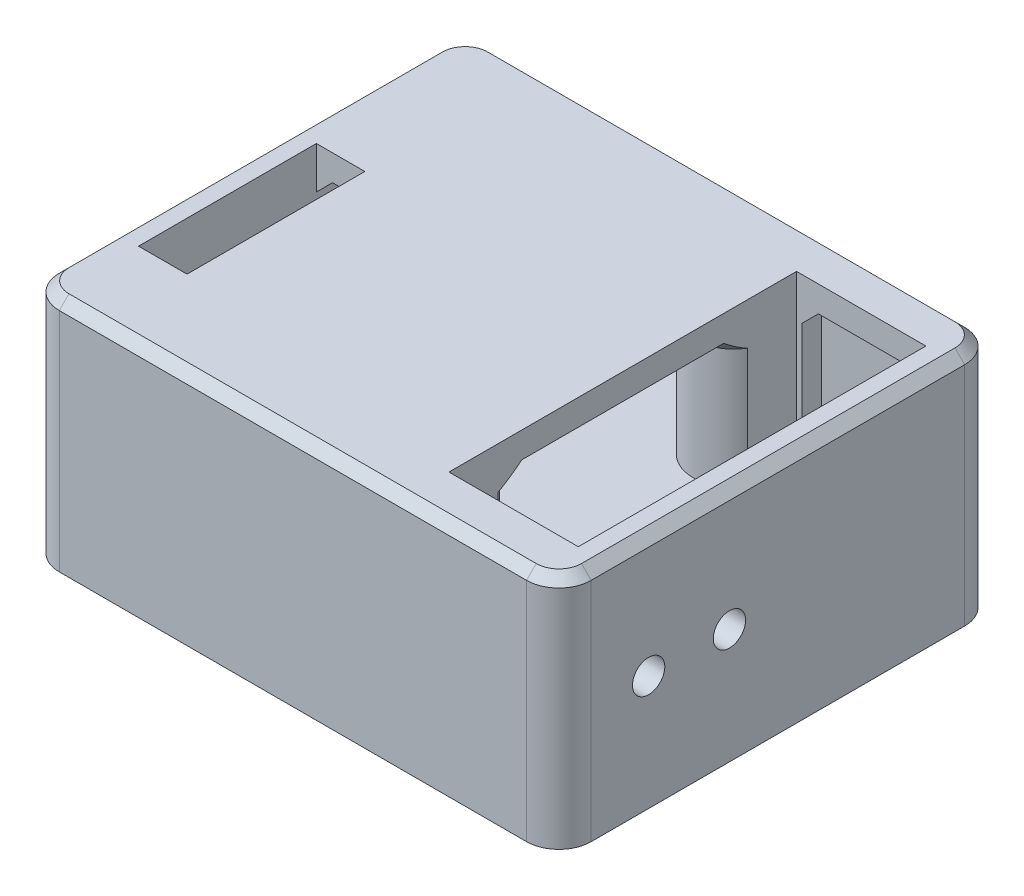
from build123d import *

# Parameters (mm, degrees)
SKICA1_W                         = 29.2
SKICA1_H                         = 23.4
P_IDAT_VYSUNUT_M1_DEPTH          = 1.2
SKICA2_R                         = 1.5
ODEBRAT_VYSUNUT_M1_DEPTH         = 19.748066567
VYSUNOUT_TENKOST_NN_1_DEPTH      = 10
VYSUNOUT_TENKOST_NN_1_DEPTH_BACK = 4.6
SKICA3_W                         = 32.9
SKICA3_H                         = 27.1
SKICA3_W_2                       = 29.7
SKICA3_H_2                       = 23.9
SKICA4_W                         = 32.9
SKICA4_H                         = 27.1
P_IDAT_VYSUNUT_M2_DEPTH          = 1.6
SKICA6_R                         = 1.35
P_IDAT_VYSUNUT_M3_DEPTH          = 8.4
ZKOSEN_1_SIZE                    = 1
ODEBRAT_START                    = -11.2
SKICA5_W                         = 8
SKICA5_H                         = 21.5
SKICA5_W_2                       = 3
SKICA5_H_2                       = 11
ODEBRAT_VYSUNUT_M2_DEPTH         = 11.2
ZAOBLIT1_R                       = 2
ZKOSEN_2_SIZE                    = 0.6
SKICA7_R                         = 1
ODEBRAT_VYSUNUT_M3_DEPTH         = 36.54282628
SKICA8_W                         = 29.2
SKICA8_H                         = 23.4
P_IDAT_VYSUNUT_M4_DEPTH          = 1.6
SKICA9_W                         = 20.2
SKICA9_H                         = 23.4
SKICA9_R                         = 1.6
P_IDAT_VYSUNUT_M5_DEPTH          = 1.6
SKICA10_R                        = 1.6
ODEBRAT_VYSUNUT_M4_DEPTH         = 25.964074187


with BuildPart() as part:
    # Skica1 → P_idat vysunut_m1 (new body)
    with BuildSketch(Plane(origin=(0, 0, 0), x_dir=(1, 0, 0), z_dir=(0, 1, 0))):
        Rectangle(SKICA1_W, SKICA1_H)
    extrude(amount=-P_IDAT_VYSUNUT_M1_DEPTH)

    # Skica2 → Odebrat vysunut_m1 (cut, through all)
    with BuildSketch(Plane(origin=(0, 0, 0), x_dir=(1, 0, 0), z_dir=(0, 1, 0))):
        with Locations(Location((-8.6, 9, 0), (0, 0, 270))):
            Circle(SKICA2_R)
        with Locations(Location((4.7, 9, 0), (0, 0, 270))):
            Circle(SKICA2_R)
        with Locations(Location((4.7, -9, 0), (0, 0, 90))):
            Circle(SKICA2_R)
        with Locations(Location((-8.6, -9, 0), (0, 0, 90))):
            Circle(SKICA2_R)
    extrude(amount=-ODEBRAT_VYSUNUT_M1_DEPTH, mode=Mode.SUBTRACT)


with BuildPart() as body_2:
    # Skica3 → Vysunout tenkost_nn_1 (new, two sides: drawn at the far end of the back side and taken through both)
    with BuildSketch(Plane(origin=(0, 0, 0), x_dir=(1, 0, 0), z_dir=(0, 1, 0)).offset(-VYSUNOUT_TENKOST_NN_1_DEPTH_BACK)):
        Rectangle(SKICA3_W, SKICA3_H)
        Rectangle(SKICA3_W_2, SKICA3_H_2, mode=Mode.SUBTRACT)
    extrude(amount=VYSUNOUT_TENKOST_NN_1_DEPTH + VYSUNOUT_TENKOST_NN_1_DEPTH_BACK)

    # Skica4 → P_idat vysunut_m2 (add)
    with BuildSketch(Plane(origin=(0, 10, 0), x_dir=(1, 0, 0), z_dir=(0, 1, 0))):
        Rectangle(SKICA4_W, SKICA4_H)
    extrude(amount=-P_IDAT_VYSUNUT_M2_DEPTH)

    # Skica6 → P_idat vysunut_m3 (add)
    # profile 1 of 4: a face of its own
    with BuildSketch(Plane.XZ.offset(-8.4)):
        with BuildLine():
            Line((-11.1, 9), (-11.1, 11.95))
            Line((-11.1, 11.95), (-6.1, 11.95))
            Line((-6.1, 11.95), (-6.1, 9))
            ThreePointArc((-6.1, 9), (-8.6, 6.5), (-11.1, 9))
        make_face()
        with Locations(Location((-8.6, 9, 0), (0, 0, 270))):
            Circle(SKICA6_R, mode=Mode.SUBTRACT)
    # profile 2 of 4: a face of its own
    with BuildSketch(Plane.XZ.offset(-8.4)):
        with BuildLine():
            Line((2.2, 9), (2.2, 11.95))
            Line((2.2, 11.95), (7.2, 11.95))
            Line((7.2, 11.95), (7.2, 9))
            ThreePointArc((7.2, 9), (4.7, 6.5), (2.2, 9))
        make_face()
        with Locations(Location((4.7, 9, 0), (0, 0, 270))):
            Circle(SKICA6_R, mode=Mode.SUBTRACT)
    # profile 3 of 4: a face of its own
    with BuildSketch(Plane.XZ.offset(-8.4)):
        with BuildLine():
            Line((7.2, -11.95), (7.2, -9))
            ThreePointArc((7.2, -9), (4.7, -6.5), (2.2, -9))
            Line((2.2, -9), (2.2, -11.95))
            Line((2.2, -11.95), (7.2, -11.95))
        make_face()
        with Locations(Location((4.7, -9, 0), (0, 0, 90))):
            Circle(SKICA6_R, mode=Mode.SUBTRACT)
    # profile 4 of 4: a face of its own
    with BuildSketch(Plane.XZ.offset(-8.4)):
        with BuildLine():
            Line((-6.1, -11.95), (-6.1, -9))
            ThreePointArc((-6.1, -9), (-8.6, -6.5), (-11.1, -9))
            Line((-11.1, -9), (-11.1, -11.95))
            Line((-11.1, -11.95), (-6.1, -11.95))
        make_face()
        with Locations(Location((-8.6, -9, 0), (0, 0, 90))):
            Circle(SKICA6_R, mode=Mode.SUBTRACT)
    extrude(amount=P_IDAT_VYSUNUT_M3_DEPTH)

    # Zkosen_1
    zkosen_1_edges = [body_2.edges().sort_by_distance(p)[0] for p in [
        (4.7, 8.4, -6.5),
        (2.2, 8.4, -10.475),
        (7.2, 8.4, -10.475),
        (-12.975, 8.4, -11.95),
        (-8.6, 8.4, -6.5),
        (-11.1, 8.4, -10.475),
        (-6.1, 8.4, -10.475),
        (-14.85, 8.4, 0),
        (-12.975, 8.4, 11.95),
        (14.85, 8.4, 0),
        (11.025, 8.4, -11.95),
        (11.025, 8.4, 11.95),
        (4.7, 8.4, 6.5),
        (7.2, 8.4, 10.475),
        (2.2, 8.4, 10.475),
        (-1.95, 8.4, 11.95),
        (-8.6, 8.4, 6.5),
        (-6.1, 8.4, 10.475),
        (-11.1, 8.4, 10.475),
        (-1.95, 8.4, -11.95),
    ]]
    chamfer(zkosen_1_edges, length=ZKOSEN_1_SIZE)

    # Skica5 → Odebrat vysunut_m2 (cut)
    with BuildSketch(Plane(origin=(0, 10, 0), x_dir=(1, 0, 0), z_dir=(0, 1, 0)).offset(ODEBRAT_START)):
        with Locations((10.85, 0)):
            Rectangle(SKICA5_W, SKICA5_H)
        with Locations((-13.35, -2.75)):
            Rectangle(SKICA5_W_2, SKICA5_H_2)
    extrude(amount=ODEBRAT_VYSUNUT_M2_DEPTH, mode=Mode.SUBTRACT)

    # Zaoblit1
    zaoblit1_edges = [body_2.edges().sort_by_distance(p)[0] for p in [
        (-16.45, 2.7, 13.55),
        (-16.45, 2.7, -13.55),
        (16.45, 2.7, -13.55),
        (16.45, 2.7, 13.55),
    ]]
    fillet(zaoblit1_edges, radius=ZAOBLIT1_R)

    # Zkosen_2
    zkosen_2_edges = [body_2.edges().sort_by_distance(p)[0] for p in [
        (-16.45, 10, 0),
        (0, 10, -13.55),
        (0, 10, 13.55),
        (16.45, 10, 0),
        (15.864213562, 10, 12.964213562),
        (-15.864213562, 10, 12.964213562),
        (15.864213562, 10, -12.964213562),
        (-15.864213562, 10, -12.964213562),
    ]]
    chamfer(zkosen_2_edges, length=ZKOSEN_2_SIZE)

    # Skica7 → Odebrat vysunut_m3 (cut, through all)
    with BuildSketch(Plane.ZY.offset(-14.85)):
        with Locations((3, 2.5)):
            Circle(SKICA7_R)
        with Locations((8, 2.5)):
            Circle(SKICA7_R)
    extrude(amount=-ODEBRAT_VYSUNUT_M3_DEPTH, mode=Mode.SUBTRACT)


with BuildPart() as body_3:
    # Skica8 → P_idat vysunut_m4 (new body)
    with BuildSketch(Plane.XZ.offset(4.6)):
        Rectangle(SKICA8_W, SKICA8_H)
    extrude(amount=-P_IDAT_VYSUNUT_M4_DEPTH)

    # Skica9 → P_idat vysunut_m5 (add)
    with BuildSketch(Plane(origin=(0, -3, 0), x_dir=(1, 0, 0), z_dir=(0, 1, 0))):
        with Locations((-1.5, 0)):
            Rectangle(SKICA9_W, SKICA9_H)
        with Locations(Location((-8.6, 9, 0), (0, 0, 270))):
            Circle(SKICA9_R, mode=Mode.SUBTRACT)
        with Locations(Location((4.7, 9, 0), (0, 0, 270))):
            Circle(SKICA9_R, mode=Mode.SUBTRACT)
        with Locations(Location((4.7, -9, 0), (0, 0, 270))):
            Circle(SKICA9_R, mode=Mode.SUBTRACT)
        with Locations(Location((-8.6, -9, 0), (0, 0, 270))):
            Circle(SKICA9_R, mode=Mode.SUBTRACT)
    extrude(amount=P_IDAT_VYSUNUT_M5_DEPTH)

    # Skica10 → Odebrat vysunut_m4 (cut, through all)
    with BuildSketch(Plane(origin=(0, -3, 0), x_dir=(1, 0, 0), z_dir=(0, 1, 0))):
        with Locations(Location((4.7, 9, 0), (0, 0, 270))):
            Circle(SKICA10_R)
        with Locations(Location((-8.6, 9, 0), (0, 0, 270))):
            Circle(SKICA10_R)
        with Locations(Location((-8.6, -9, 0), (0, 0, 270))):
            Circle(SKICA10_R)
        with Locations(Location((4.7, -9, 0), (0, 0, 270))):
            Circle(SKICA10_R)
    extrude(amount=-ODEBRAT_VYSUNUT_M4_DEPTH, mode=Mode.SUBTRACT)


solid = Compound([part.part, body_2.part, body_3.part])
